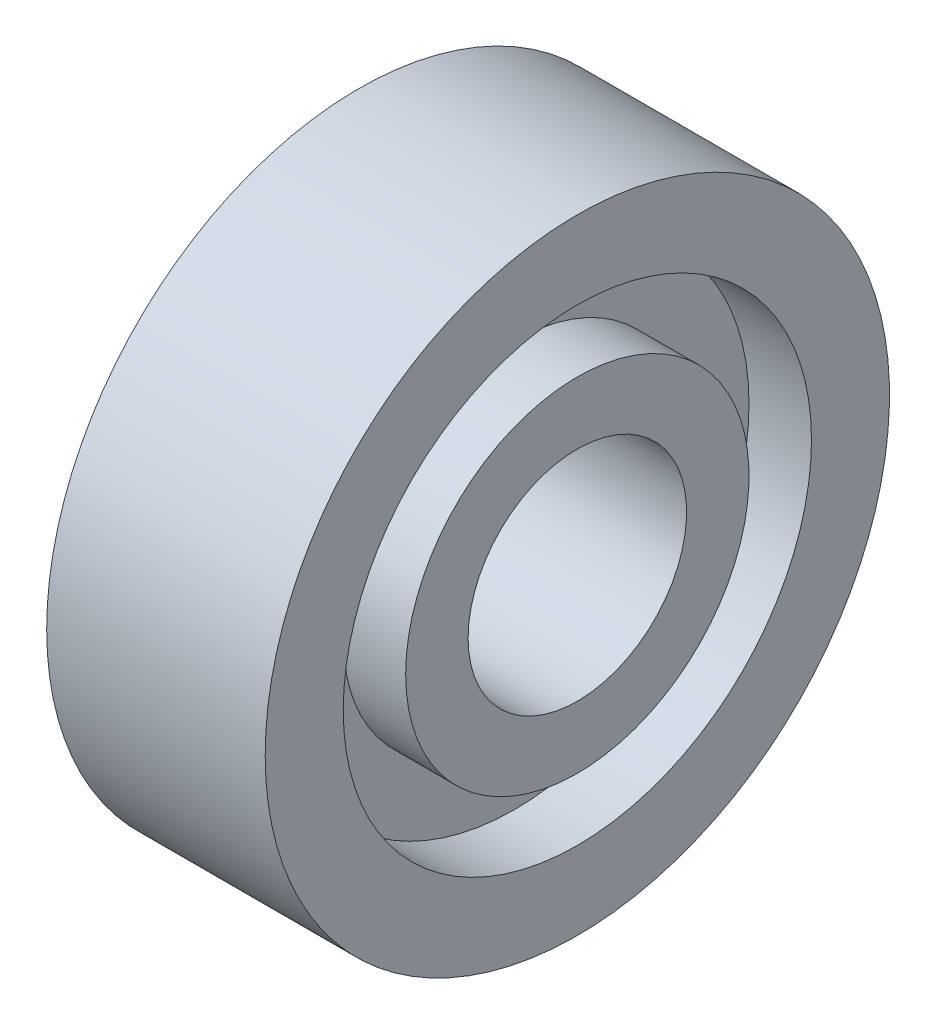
ISO-10303-21;
HEADER;
FILE_DESCRIPTION(('STEP AP214'),'2;1');
FILE_NAME('part.step','',(''),(''),'','','');
FILE_SCHEMA(('AUTOMOTIVE_DESIGN { 1 0 10303 214 1 1 1 1 }'));
ENDSEC;
DATA;
#1=APPLICATION_CONTEXT('core data for automotive mechanical design processes');
#2=APPLICATION_PROTOCOL_DEFINITION('international standard','automotive_design',2000,#1);
#3=PRODUCT_CONTEXT('',#1,'mechanical');
#4=PRODUCT('Part','Part','',(#3));
#5=PRODUCT_RELATED_PRODUCT_CATEGORY('part','',(#4));
#6=PRODUCT_DEFINITION_FORMATION('','',#4);
#7=PRODUCT_DEFINITION_CONTEXT('part definition',#1,'design');
#8=PRODUCT_DEFINITION('design','',#6,#7);
#9=PRODUCT_DEFINITION_SHAPE('','',#8);
#10=(LENGTH_UNIT() NAMED_UNIT(*) SI_UNIT(.MILLI.,.METRE.));
#11=(NAMED_UNIT(*) PLANE_ANGLE_UNIT() SI_UNIT($,.RADIAN.));
#12=(NAMED_UNIT(*) SI_UNIT($,.STERADIAN.) SOLID_ANGLE_UNIT());
#13=UNCERTAINTY_MEASURE_WITH_UNIT(LENGTH_MEASURE(1.E-05),#10,'distance_accuracy_value','');
#14=(GEOMETRIC_REPRESENTATION_CONTEXT(3) GLOBAL_UNCERTAINTY_ASSIGNED_CONTEXT((#13)) GLOBAL_UNIT_ASSIGNED_CONTEXT((#10,
#11,#12)) REPRESENTATION_CONTEXT('',''));
#15=CARTESIAN_POINT('',(0.,0.,0.));
#16=DIRECTION('',(0.,0.,1.));
#17=DIRECTION('',(1.,0.,0.));
#18=AXIS2_PLACEMENT_3D('',#15,#16,#17);
#19=CARTESIAN_POINT('',(0.,0.,0.));
#20=DIRECTION('',(-1.,0.,0.));
#21=DIRECTION('',(0.,0.,1.));
#22=AXIS2_PLACEMENT_3D('',#19,#20,#21);
#23=CYLINDRICAL_SURFACE('',#22,10.);
#24=CARTESIAN_POINT('',(0.,0.,0.));
#25=DIRECTION('',(-1.,0.,0.));
#26=DIRECTION('',(0.,0.,1.));
#27=AXIS2_PLACEMENT_3D('',#24,#25,#26);
#28=CIRCLE('',#27,10.);
#29=CARTESIAN_POINT('',(0.,0.,10.));
#30=VERTEX_POINT('',#29);
#31=EDGE_CURVE('E57',#30,#30,#28,.T.);
#32=ORIENTED_EDGE('',*,*,#31,.F.);
#33=EDGE_LOOP('',(#32));
#34=FACE_BOUND('',#33,.T.);
#35=CARTESIAN_POINT('',(7.,0.,0.));
#36=DIRECTION('',(-1.,0.,0.));
#37=DIRECTION('',(0.,0.,1.));
#38=AXIS2_PLACEMENT_3D('',#35,#36,#37);
#39=CIRCLE('',#38,10.);
#40=CARTESIAN_POINT('',(7.,0.,10.));
#41=VERTEX_POINT('',#40);
#42=EDGE_CURVE('E10',#41,#41,#39,.T.);
#43=ORIENTED_EDGE('',*,*,#42,.T.);
#44=EDGE_LOOP('',(#43));
#45=FACE_BOUND('',#44,.T.);
#46=ADVANCED_FACE('F29',(#34,#45),#23,.T.);
#47=CARTESIAN_POINT('',(7.,10.,0.));
#48=DIRECTION('',(-1.,0.,0.));
#49=DIRECTION('',(0.,0.,1.));
#50=AXIS2_PLACEMENT_3D('',#47,#48,#49);
#51=PLANE('',#50);
#52=ORIENTED_EDGE('',*,*,#42,.F.);
#53=EDGE_LOOP('',(#52));
#54=FACE_BOUND('',#53,.T.);
#55=CARTESIAN_POINT('',(7.,0.,0.));
#56=DIRECTION('',(-1.,0.,0.));
#57=DIRECTION('',(0.,0.,1.));
#58=AXIS2_PLACEMENT_3D('',#55,#56,#57);
#59=CIRCLE('',#58,7.5);
#60=CARTESIAN_POINT('',(7.,0.,7.5));
#61=VERTEX_POINT('',#60);
#62=EDGE_CURVE('E35',#61,#61,#59,.T.);
#63=ORIENTED_EDGE('',*,*,#62,.T.);
#64=EDGE_LOOP('',(#63));
#65=FACE_BOUND('',#64,.T.);
#66=ADVANCED_FACE('F64',(#54,#65),#51,.F.);
#67=CARTESIAN_POINT('',(0.,0.,0.));
#68=DIRECTION('',(-1.,0.,0.));
#69=DIRECTION('',(0.,0.,1.));
#70=AXIS2_PLACEMENT_3D('',#67,#68,#69);
#71=CYLINDRICAL_SURFACE('',#70,7.5);
#72=ORIENTED_EDGE('',*,*,#62,.F.);
#73=EDGE_LOOP('',(#72));
#74=FACE_BOUND('',#73,.T.);
#75=CARTESIAN_POINT('',(5.,0.,0.));
#76=DIRECTION('',(-1.,0.,0.));
#77=DIRECTION('',(0.,0.,1.));
#78=AXIS2_PLACEMENT_3D('',#75,#76,#77);
#79=CIRCLE('',#78,7.5);
#80=CARTESIAN_POINT('',(5.,0.,7.5));
#81=VERTEX_POINT('',#80);
#82=EDGE_CURVE('E39',#81,#81,#79,.T.);
#83=ORIENTED_EDGE('',*,*,#82,.T.);
#84=EDGE_LOOP('',(#83));
#85=FACE_BOUND('',#84,.T.);
#86=ADVANCED_FACE('F68',(#74,#85),#71,.F.);
#87=CARTESIAN_POINT('',(5.,7.5,0.));
#88=DIRECTION('',(-1.,0.,0.));
#89=DIRECTION('',(0.,0.,1.));
#90=AXIS2_PLACEMENT_3D('',#87,#88,#89);
#91=PLANE('',#90);
#92=ORIENTED_EDGE('',*,*,#82,.F.);
#93=EDGE_LOOP('',(#92));
#94=FACE_BOUND('',#93,.T.);
#95=CARTESIAN_POINT('',(5.,0.,0.));
#96=DIRECTION('',(-1.,0.,0.));
#97=DIRECTION('',(0.,0.,1.));
#98=AXIS2_PLACEMENT_3D('',#95,#96,#97);
#99=CIRCLE('',#98,5.5);
#100=CARTESIAN_POINT('',(5.,0.,5.5));
#101=VERTEX_POINT('',#100);
#102=EDGE_CURVE('E43',#101,#101,#99,.T.);
#103=ORIENTED_EDGE('',*,*,#102,.T.);
#104=EDGE_LOOP('',(#103));
#105=FACE_BOUND('',#104,.T.);
#106=ADVANCED_FACE('F73',(#94,#105),#91,.F.);
#107=CARTESIAN_POINT('',(0.,0.,0.));
#108=DIRECTION('',(-1.,0.,0.));
#109=DIRECTION('',(0.,0.,1.));
#110=AXIS2_PLACEMENT_3D('',#107,#108,#109);
#111=CYLINDRICAL_SURFACE('',#110,5.5);
#112=ORIENTED_EDGE('',*,*,#102,.F.);
#113=EDGE_LOOP('',(#112));
#114=FACE_BOUND('',#113,.T.);
#115=CARTESIAN_POINT('',(7.,0.,0.));
#116=DIRECTION('',(-1.,0.,0.));
#117=DIRECTION('',(0.,0.,1.));
#118=AXIS2_PLACEMENT_3D('',#115,#116,#117);
#119=CIRCLE('',#118,5.5);
#120=CARTESIAN_POINT('',(7.,0.,5.5));
#121=VERTEX_POINT('',#120);
#122=EDGE_CURVE('E48',#121,#121,#119,.T.);
#123=ORIENTED_EDGE('',*,*,#122,.T.);
#124=EDGE_LOOP('',(#123));
#125=FACE_BOUND('',#124,.T.);
#126=ADVANCED_FACE('F79',(#114,#125),#111,.T.);
#127=CARTESIAN_POINT('',(7.,5.5,0.));
#128=DIRECTION('',(-1.,0.,0.));
#129=DIRECTION('',(0.,0.,1.));
#130=AXIS2_PLACEMENT_3D('',#127,#128,#129);
#131=PLANE('',#130);
#132=ORIENTED_EDGE('',*,*,#122,.F.);
#133=EDGE_LOOP('',(#132));
#134=FACE_BOUND('',#133,.T.);
#135=CARTESIAN_POINT('',(7.,0.,0.));
#136=DIRECTION('',(-1.,0.,0.));
#137=DIRECTION('',(0.,0.,1.));
#138=AXIS2_PLACEMENT_3D('',#135,#136,#137);
#139=CIRCLE('',#138,3.5);
#140=CARTESIAN_POINT('',(7.,0.,3.5));
#141=VERTEX_POINT('',#140);
#142=EDGE_CURVE('E51',#141,#141,#139,.T.);
#143=ORIENTED_EDGE('',*,*,#142,.T.);
#144=EDGE_LOOP('',(#143));
#145=FACE_BOUND('',#144,.T.);
#146=ADVANCED_FACE('F83',(#134,#145),#131,.F.);
#147=CARTESIAN_POINT('',(0.,0.,0.));
#148=DIRECTION('',(-1.,0.,0.));
#149=DIRECTION('',(0.,0.,1.));
#150=AXIS2_PLACEMENT_3D('',#147,#148,#149);
#151=CYLINDRICAL_SURFACE('',#150,3.5);
#152=ORIENTED_EDGE('',*,*,#142,.F.);
#153=EDGE_LOOP('',(#152));
#154=FACE_BOUND('',#153,.T.);
#155=CARTESIAN_POINT('',(0.,0.,0.));
#156=DIRECTION('',(-1.,0.,0.));
#157=DIRECTION('',(0.,0.,1.));
#158=AXIS2_PLACEMENT_3D('',#155,#156,#157);
#159=CIRCLE('',#158,3.5);
#160=CARTESIAN_POINT('',(0.,0.,3.5));
#161=VERTEX_POINT('',#160);
#162=EDGE_CURVE('E54',#161,#161,#159,.T.);
#163=ORIENTED_EDGE('',*,*,#162,.T.);
#164=EDGE_LOOP('',(#163));
#165=FACE_BOUND('',#164,.T.);
#166=ADVANCED_FACE('F87',(#154,#165),#151,.F.);
#167=CARTESIAN_POINT('',(0.,3.5,0.));
#168=DIRECTION('',(1.,0.,0.));
#169=DIRECTION('',(0.,0.,-1.));
#170=AXIS2_PLACEMENT_3D('',#167,#168,#169);
#171=PLANE('',#170);
#172=ORIENTED_EDGE('',*,*,#162,.F.);
#173=EDGE_LOOP('',(#172));
#174=FACE_BOUND('',#173,.T.);
#175=ORIENTED_EDGE('',*,*,#31,.T.);
#176=EDGE_LOOP('',(#175));
#177=FACE_BOUND('',#176,.T.);
#178=ADVANCED_FACE('F61',(#174,#177),#171,.F.);
#179=CLOSED_SHELL('',(#46,#66,#86,#106,#126,#146,#166,#178));
#180=MANIFOLD_SOLID_BREP('B2',#179);
#181=ADVANCED_BREP_SHAPE_REPRESENTATION('',(#18,#180),#14);
#182=SHAPE_DEFINITION_REPRESENTATION(#9,#181);
ENDSEC;
END-ISO-10303-21;
